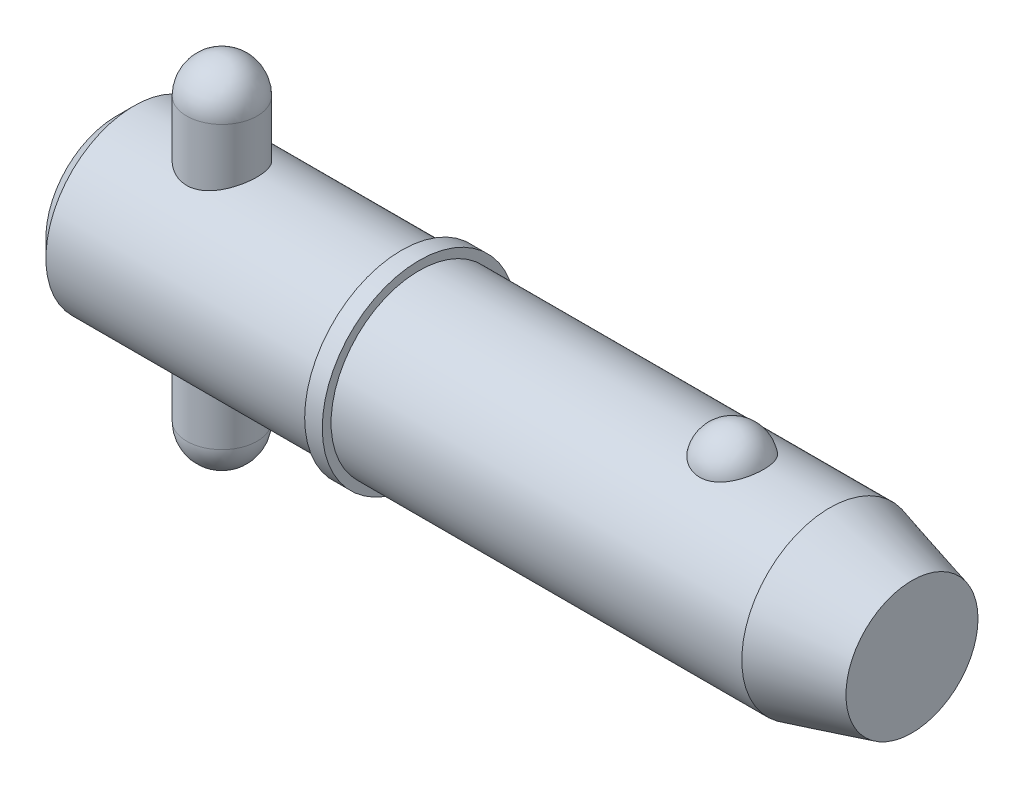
ISO-10303-21;
HEADER;
FILE_DESCRIPTION(('STEP AP214'),'2;1');
FILE_NAME('part.step','',(''),(''),'','','');
FILE_SCHEMA(('AUTOMOTIVE_DESIGN { 1 0 10303 214 1 1 1 1 }'));
ENDSEC;
DATA;
#1=APPLICATION_CONTEXT('core data for automotive mechanical design processes');
#2=APPLICATION_PROTOCOL_DEFINITION('international standard','automotive_design',2000,#1);
#3=PRODUCT_CONTEXT('',#1,'mechanical');
#4=PRODUCT('Part','Part','',(#3));
#5=PRODUCT_RELATED_PRODUCT_CATEGORY('part','',(#4));
#6=PRODUCT_DEFINITION_FORMATION('','',#4);
#7=PRODUCT_DEFINITION_CONTEXT('part definition',#1,'design');
#8=PRODUCT_DEFINITION('design','',#6,#7);
#9=PRODUCT_DEFINITION_SHAPE('','',#8);
#10=(LENGTH_UNIT() NAMED_UNIT(*) SI_UNIT(.MILLI.,.METRE.));
#11=(NAMED_UNIT(*) PLANE_ANGLE_UNIT() SI_UNIT($,.RADIAN.));
#12=(NAMED_UNIT(*) SI_UNIT($,.STERADIAN.) SOLID_ANGLE_UNIT());
#13=UNCERTAINTY_MEASURE_WITH_UNIT(LENGTH_MEASURE(1.E-05),#10,'distance_accuracy_value','');
#14=(GEOMETRIC_REPRESENTATION_CONTEXT(3) GLOBAL_UNCERTAINTY_ASSIGNED_CONTEXT((#13)) GLOBAL_UNIT_ASSIGNED_CONTEXT((#10,
#11,#12)) REPRESENTATION_CONTEXT('',''));
#15=CARTESIAN_POINT('',(0.,0.,0.));
#16=DIRECTION('',(0.,0.,1.));
#17=DIRECTION('',(1.,0.,0.));
#18=AXIS2_PLACEMENT_3D('',#15,#16,#17);
#19=CARTESIAN_POINT('',(9.525,15.875,0.));
#20=DIRECTION('',(0.,-1.,0.));
#21=DIRECTION('',(0.,0.,-1.));
#22=AXIS2_PLACEMENT_3D('',#19,#20,#21);
#23=CYLINDRICAL_SURFACE('',#22,3.175);
#24=CARTESIAN_POINT('',(9.525,-12.7,0.));
#25=DIRECTION('',(0.,-1.,0.));
#26=DIRECTION('',(0.,0.,-1.));
#27=AXIS2_PLACEMENT_3D('',#24,#25,#26);
#28=CIRCLE('',#27,3.175);
#29=CARTESIAN_POINT('',(9.525,-12.7,-3.175));
#30=VERTEX_POINT('',#29);
#31=EDGE_CURVE('P0_E10',#30,#30,#28,.F.);
#32=ORIENTED_EDGE('',*,*,#31,.T.);
#33=EDGE_LOOP('',(#32));
#34=FACE_BOUND('',#33,.T.);
#35=CARTESIAN_POINT('',(9.525,12.7,0.));
#36=DIRECTION('',(0.,-1.,0.));
#37=DIRECTION('',(0.,0.,-1.));
#38=AXIS2_PLACEMENT_3D('',#35,#36,#37);
#39=CIRCLE('',#38,3.175);
#40=CARTESIAN_POINT('',(9.525,12.7,-3.175));
#41=VERTEX_POINT('',#40);
#42=EDGE_CURVE('P0_E21',#41,#41,#39,.T.);
#43=ORIENTED_EDGE('',*,*,#42,.T.);
#44=EDGE_LOOP('',(#43));
#45=FACE_BOUND('',#44,.T.);
#46=ADVANCED_FACE('P0_F14',(#34,#45),#23,.T.);
#47=CARTESIAN_POINT('',(9.525,-12.7,0.));
#48=DIRECTION('',(0.,0.,1.));
#49=DIRECTION('',(1.,0.,0.));
#50=AXIS2_PLACEMENT_3D('',#47,#48,#49);
#51=SPHERICAL_SURFACE('',#50,3.175);
#52=CARTESIAN_POINT('',(9.525,-12.7,0.));
#53=DIRECTION('',(0.,-1.,0.));
#54=DIRECTION('',(0.,0.,-1.));
#55=AXIS2_PLACEMENT_3D('',#52,#53,#54);
#56=SPHERICAL_SURFACE('',#55,3.175);
#57=ORIENTED_EDGE('',*,*,#31,.F.);
#58=EDGE_LOOP('',(#57));
#59=FACE_BOUND('',#58,.T.);
#60=ADVANCED_FACE('P0_F29',(#59),#56,.T.);
#61=CARTESIAN_POINT('',(9.525,12.7,0.));
#62=DIRECTION('',(0.,0.,1.));
#63=DIRECTION('',(1.,0.,0.));
#64=AXIS2_PLACEMENT_3D('',#61,#62,#63);
#65=SPHERICAL_SURFACE('',#64,3.175);
#66=CARTESIAN_POINT('',(9.525,12.7,0.));
#67=DIRECTION('',(0.,-1.,0.));
#68=DIRECTION('',(0.,0.,-1.));
#69=AXIS2_PLACEMENT_3D('',#66,#67,#68);
#70=SPHERICAL_SURFACE('',#69,3.175);
#71=ORIENTED_EDGE('',*,*,#42,.F.);
#72=EDGE_LOOP('',(#71));
#73=FACE_BOUND('',#72,.T.);
#74=ADVANCED_FACE('P0_F16',(#73),#70,.T.);
#75=CLOSED_SHELL('',(#46,#60,#74));
#76=MANIFOLD_SOLID_BREP('P0_B1',#75);
#77=CARTESIAN_POINT('',(0.,0.,0.));
#78=DIRECTION('',(1.,0.,0.));
#79=DIRECTION('',(0.,0.,-1.));
#80=AXIS2_PLACEMENT_3D('',#77,#78,#79);
#81=CYLINDRICAL_SURFACE('',#80,7.94);
#82=CARTESIAN_POINT('',(64.3518791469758,0.,0.));
#83=DIRECTION('',(1.,0.,0.));
#84=DIRECTION('',(0.,0.,-1.));
#85=AXIS2_PLACEMENT_3D('',#82,#83,#84);
#86=CIRCLE('',#85,7.94);
#87=CARTESIAN_POINT('',(64.3518791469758,0.,-7.94));
#88=VERTEX_POINT('',#87);
#89=EDGE_CURVE('P1_E81',#88,#88,#86,.T.);
#90=ORIENTED_EDGE('',*,*,#89,.F.);
#91=EDGE_LOOP('',(#90));
#92=FACE_BOUND('',#91,.T.);
#93=CARTESIAN_POINT('',(27.31,0.,0.));
#94=DIRECTION('',(1.,0.,0.));
#95=DIRECTION('',(0.,0.,-1.));
#96=AXIS2_PLACEMENT_3D('',#93,#94,#95);
#97=CIRCLE('',#96,7.94);
#98=CARTESIAN_POINT('',(27.31,0.,-7.94));
#99=VERTEX_POINT('',#98);
#100=EDGE_CURVE('P1_E85',#99,#99,#97,.T.);
#101=ORIENTED_EDGE('',*,*,#100,.T.);
#102=EDGE_LOOP('',(#101));
#103=FACE_BOUND('',#102,.T.);
#104=CARTESIAN_POINT('',(55.5449074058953,7.37767842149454,2.93486986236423));
#105=CARTESIAN_POINT('',(55.3927496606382,7.3776732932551,2.93487505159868));
#106=CARTESIAN_POINT('',(55.2406329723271,7.38258419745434,2.92262454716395));
#107=CARTESIAN_POINT('',(54.9409284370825,7.40163229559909,2.87404196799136));
#108=CARTESIAN_POINT('',(54.7933394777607,7.41576720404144,2.83771585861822));
#109=CARTESIAN_POINT('',(54.5070187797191,7.4516157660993,2.74218769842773));
#110=CARTESIAN_POINT('',(54.3682745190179,7.47331841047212,2.68301886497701));
#111=CARTESIAN_POINT('',(54.1028822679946,7.52194082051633,2.54350967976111));
#112=CARTESIAN_POINT('',(53.9762366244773,7.5488615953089,2.46316523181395));
#113=CARTESIAN_POINT('',(53.7345349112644,7.60594671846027,2.2809037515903));
#114=CARTESIAN_POINT('',(53.6199065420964,7.63618114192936,2.17844211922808));
#115=CARTESIAN_POINT('',(53.4088787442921,7.69614046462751,1.95608495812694));
#116=CARTESIAN_POINT('',(53.3124826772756,7.72586526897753,1.83618622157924));
#117=CARTESIAN_POINT('',(53.1359381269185,7.78314821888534,1.57628086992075));
#118=CARTESIAN_POINT('',(53.0567072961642,7.81055035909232,1.43561546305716));
#119=CARTESIAN_POINT('',(52.9217979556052,7.85879631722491,1.14236334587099));
#120=CARTESIAN_POINT('',(52.8661216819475,7.87963951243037,0.989775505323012));
#121=CARTESIAN_POINT('',(52.7788121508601,7.91289645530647,0.674619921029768));
#122=CARTESIAN_POINT('',(52.7475309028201,7.925186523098,0.511941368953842));
#123=CARTESIAN_POINT('',(52.710975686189,7.93958930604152,0.183247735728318));
#124=CARTESIAN_POINT('',(52.7057012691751,7.94170219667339,0.0172327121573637));
#125=CARTESIAN_POINT('',(52.7212311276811,7.93554931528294,-0.31267286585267));
#126=CARTESIAN_POINT('',(52.7419253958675,7.92732732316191,-0.4765694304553));
#127=CARTESIAN_POINT('',(52.8087865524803,7.90141534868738,-0.798305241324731));
#128=CARTESIAN_POINT('',(52.8549539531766,7.88372517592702,-0.956144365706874));
#129=CARTESIAN_POINT('',(52.9718986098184,7.84066230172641,-1.26152073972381));
#130=CARTESIAN_POINT('',(53.0427046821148,7.81528060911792,-1.40904568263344));
#131=CARTESIAN_POINT('',(53.2074789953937,7.7594867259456,-1.68950598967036));
#132=CARTESIAN_POINT('',(53.3014488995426,7.72907417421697,-1.82244030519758));
#133=CARTESIAN_POINT('',(53.5108391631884,7.66640424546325,-2.07032792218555));
#134=CARTESIAN_POINT('',(53.6263152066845,7.63414223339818,-2.1852330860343));
#135=CARTESIAN_POINT('',(53.8759006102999,7.57149681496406,-2.39329737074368));
#136=CARTESIAN_POINT('',(54.0100080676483,7.54111321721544,-2.48645870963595));
#137=CARTESIAN_POINT('',(54.2901113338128,7.48650742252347,-2.64628132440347));
#138=CARTESIAN_POINT('',(54.4357605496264,7.46215900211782,-2.71350554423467));
#139=CARTESIAN_POINT('',(54.7374259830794,7.42171253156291,-2.82226614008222));
#140=CARTESIAN_POINT('',(54.8934383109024,7.40561140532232,-2.86381209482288));
#141=CARTESIAN_POINT('',(55.2029708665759,7.3842679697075,-2.9183907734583));
#142=CARTESIAN_POINT('',(55.3562229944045,7.37852109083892,-2.93275024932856));
#143=CARTESIAN_POINT('',(55.6630705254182,7.37700973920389,-2.93655208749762));
#144=CARTESIAN_POINT('',(55.8166658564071,7.38124333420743,-2.92599927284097));
#145=CARTESIAN_POINT('',(56.1149907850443,7.39890635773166,-2.88102897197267));
#146=CARTESIAN_POINT('',(56.2598480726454,7.41205491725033,-2.8473399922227));
#147=CARTESIAN_POINT('',(56.5416432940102,7.445801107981,-2.75788206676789));
#148=CARTESIAN_POINT('',(56.6785805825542,7.46639934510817,-2.70211132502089));
#149=CARTESIAN_POINT('',(56.9440619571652,7.51339098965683,-2.56858908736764));
#150=CARTESIAN_POINT('',(57.0723548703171,7.53990200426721,-2.49038067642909));
#151=CARTESIAN_POINT('',(57.3142440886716,7.59569503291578,-2.31462737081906));
#152=CARTESIAN_POINT('',(57.4278370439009,7.62497767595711,-2.21707808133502));
#153=CARTESIAN_POINT('',(57.64322156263,7.68489473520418,-1.99982049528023));
#154=CARTESIAN_POINT('',(57.7441488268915,7.71552419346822,-1.87925337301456));
#155=CARTESIAN_POINT('',(57.9251866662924,7.77353016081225,-1.62268826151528));
#156=CARTESIAN_POINT('',(58.0052934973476,7.80090608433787,-1.4866875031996));
#157=CARTESIAN_POINT('',(58.1453615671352,7.85047992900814,-1.19818413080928));
#158=CARTESIAN_POINT('',(58.2045877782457,7.8724818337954,-1.04529016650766));
#159=CARTESIAN_POINT('',(58.2979821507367,7.90785114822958,-0.731080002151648));
#160=CARTESIAN_POINT('',(58.3321497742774,7.92121837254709,-0.569763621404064));
#161=CARTESIAN_POINT('',(58.374795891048,7.93797834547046,-0.242812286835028));
#162=CARTESIAN_POINT('',(58.3832047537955,7.94134405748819,-0.0771668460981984));
#163=CARTESIAN_POINT('',(58.3739626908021,7.93767937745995,0.253276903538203));
#164=CARTESIAN_POINT('',(58.3563120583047,7.93064910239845,0.418075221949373));
#165=CARTESIAN_POINT('',(58.2954247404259,7.90695571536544,0.741525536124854));
#166=CARTESIAN_POINT('',(58.2522819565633,7.8903279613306,0.900197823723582));
#167=CARTESIAN_POINT('',(58.1413535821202,7.84916386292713,1.20759654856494));
#168=CARTESIAN_POINT('',(58.07356656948,7.82462706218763,1.35632241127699));
#169=CARTESIAN_POINT('',(57.9143718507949,7.7700669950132,1.64032869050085));
#170=CARTESIAN_POINT('',(57.8228616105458,7.7400200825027,1.77554712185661));
#171=CARTESIAN_POINT('',(57.6182960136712,7.67774175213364,2.02800648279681));
#172=CARTESIAN_POINT('',(57.5052410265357,7.64551037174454,2.14524772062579));
#173=CARTESIAN_POINT('',(57.2608318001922,7.58265895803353,2.35778002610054));
#174=CARTESIAN_POINT('',(57.1295833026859,7.5520309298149,2.45319004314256));
#175=CARTESIAN_POINT('',(56.851601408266,7.49579792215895,2.61999897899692));
#176=CARTESIAN_POINT('',(56.7048670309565,7.47019326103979,2.69139637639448));
#177=CARTESIAN_POINT('',(56.3929477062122,7.42622216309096,2.8105324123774));
#178=CARTESIAN_POINT('',(56.2272209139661,7.40825002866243,2.85700910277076));
#179=CARTESIAN_POINT('',(55.8892792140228,7.38398348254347,2.9191685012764));
#180=CARTESIAN_POINT('',(55.7170670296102,7.3776842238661,2.93486399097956));
#181=CARTESIAN_POINT('',(55.5449074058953,7.37767842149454,2.93486986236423));
#182=B_SPLINE_CURVE_WITH_KNOTS('',3,(#104,#105,#106,#107,#108,#109,#110,#111,#112,#113,#114,
#115,#116,#117,#118,#119,#120,#121,#122,#123,#124,#125,#126,#127,#128,#129,#130,#131,#132,#133,
#134,#135,#136,#137,#138,#139,#140,#141,#142,#143,#144,#145,#146,#147,#148,#149,#150,#151,#152,
#153,#154,#155,#156,#157,#158,#159,#160,#161,#162,#163,#164,#165,#166,#167,#168,#169,#170,#171,
#172,#173,#174,#175,#176,#177,#178,#179,#180,#181),.UNSPECIFIED.,.T.,.F.,(4,2,2,2,2,2,2,2,2,2,2,
2,2,2,2,2,2,2,2,2,2,2,2,2,2,2,2,2,2,2,2,2,2,2,2,2,2,2,4),(0.,0.45584132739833,0.911569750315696,
1.36663794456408,1.82179423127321,2.28978983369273,2.7578716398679,3.246853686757,
3.73588214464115,4.23184282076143,4.72779494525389,5.22165321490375,5.71552141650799,
6.20996917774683,6.70445245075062,7.20023431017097,7.69596557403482,8.18023418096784,
8.66432203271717,9.12410697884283,9.58380291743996,10.0296503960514,10.4755341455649,
10.9312349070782,11.3870393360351,11.8654416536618,12.3439299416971,12.8378875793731,
13.3318558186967,13.8271581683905,14.3224549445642,14.8159385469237,15.3094506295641,
15.8051323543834,16.3008055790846,16.7937101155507,17.2866458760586,17.8026240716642,
18.3183879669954),.UNSPECIFIED.);
#183=CARTESIAN_POINT('',(55.5449074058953,7.37767842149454,2.93486986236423));
#184=VERTEX_POINT('',#183);
#185=EDGE_CURVE('P1_E35',#184,#184,#182,.T.);
#186=ORIENTED_EDGE('',*,*,#185,.T.);
#187=EDGE_LOOP('',(#186));
#188=FACE_BOUND('',#187,.T.);
#189=ADVANCED_FACE('P1_F13',(#92,#103,#188),#81,.T.);
#190=CARTESIAN_POINT('',(0.,0.,0.));
#191=DIRECTION('',(-1.,0.,0.));
#192=DIRECTION('',(0.,0.,1.));
#193=AXIS2_PLACEMENT_3D('',#190,#191,#192);
#194=PLANE('',#193);
#195=CARTESIAN_POINT('',(0.,0.,0.));
#196=DIRECTION('',(1.,0.,0.));
#197=DIRECTION('',(0.,0.,-1.));
#198=AXIS2_PLACEMENT_3D('',#195,#196,#197);
#199=CIRCLE('',#198,6.352);
#200=CARTESIAN_POINT('',(0.,0.,-6.352));
#201=VERTEX_POINT('',#200);
#202=EDGE_CURVE('P1_E9',#201,#201,#199,.T.);
#203=ORIENTED_EDGE('',*,*,#202,.F.);
#204=EDGE_LOOP('',(#203));
#205=FACE_BOUND('',#204,.T.);
#206=ADVANCED_FACE('P1_F15',(#205),#194,.T.);
#207=CARTESIAN_POINT('',(1.58799999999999,0.,0.));
#208=DIRECTION('',(1.,0.,0.));
#209=DIRECTION('',(0.,0.,-1.));
#210=AXIS2_PLACEMENT_3D('',#207,#208,#209);
#211=CONICAL_SURFACE('',#210,7.94,0.78539816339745);
#212=ORIENTED_EDGE('',*,*,#202,.T.);
#213=EDGE_LOOP('',(#212));
#214=FACE_BOUND('',#213,.T.);
#215=CARTESIAN_POINT('',(1.58799999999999,0.,0.));
#216=DIRECTION('',(1.,0.,0.));
#217=DIRECTION('',(0.,0.,-1.));
#218=AXIS2_PLACEMENT_3D('',#215,#216,#217);
#219=CIRCLE('',#218,7.94);
#220=CARTESIAN_POINT('',(1.58799999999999,0.,-7.94));
#221=VERTEX_POINT('',#220);
#222=EDGE_CURVE('P1_E26',#221,#221,#219,.T.);
#223=ORIENTED_EDGE('',*,*,#222,.F.);
#224=EDGE_LOOP('',(#223));
#225=FACE_BOUND('',#224,.T.);
#226=ADVANCED_FACE('P1_F77',(#214,#225),#211,.T.);
#227=CARTESIAN_POINT('',(0.,0.,0.));
#228=DIRECTION('',(1.,0.,0.));
#229=DIRECTION('',(0.,0.,-1.));
#230=AXIS2_PLACEMENT_3D('',#227,#228,#229);
#231=CYLINDRICAL_SURFACE('',#230,7.94);
#232=CARTESIAN_POINT('',(9.525,-7.27756655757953,3.175));
#233=CARTESIAN_POINT('',(9.43992346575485,-7.27756715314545,3.17499935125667));
#234=CARTESIAN_POINT('',(9.35481882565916,-7.27906496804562,3.1715736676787));
#235=CARTESIAN_POINT('',(9.18524505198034,-7.28499816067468,3.15791803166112));
#236=CARTESIAN_POINT('',(9.100776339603,-7.28943533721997,3.14768391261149));
#237=CARTESIAN_POINT('',(8.84895715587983,-7.30698881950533,3.10684226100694));
#238=CARTESIAN_POINT('',(8.6834173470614,-7.32434654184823,3.06609574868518));
#239=CARTESIAN_POINT('',(8.36278910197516,-7.36806950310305,2.95945910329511));
#240=CARTESIAN_POINT('',(8.20766386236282,-7.39440078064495,2.89366366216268));
#241=CARTESIAN_POINT('',(7.91065319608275,-7.45304562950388,2.73907413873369));
#242=CARTESIAN_POINT('',(7.76876488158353,-7.48535789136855,2.65028508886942));
#243=CARTESIAN_POINT('',(7.49411086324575,-7.55439482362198,2.44679888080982));
#244=CARTESIAN_POINT('',(7.36219910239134,-7.59126138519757,2.33099745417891));
#245=CARTESIAN_POINT('',(7.11904234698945,-7.66408045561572,2.07909838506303));
#246=CARTESIAN_POINT('',(7.00780457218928,-7.70003264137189,1.94299368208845));
#247=CARTESIAN_POINT('',(6.80492173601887,-7.76867514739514,1.64775981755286));
#248=CARTESIAN_POINT('',(6.71422139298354,-7.80118112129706,1.48793473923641));
#249=CARTESIAN_POINT('',(6.56135788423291,-7.85754918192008,1.15376269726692));
#250=CARTESIAN_POINT('',(6.49918311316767,-7.88141478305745,0.979421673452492));
#251=CARTESIAN_POINT('',(6.40818142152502,-7.91680873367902,0.630115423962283));
#252=CARTESIAN_POINT('',(6.3778864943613,-7.9288781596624,0.455588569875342));
#253=CARTESIAN_POINT('',(6.34677743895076,-7.94127547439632,0.103539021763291));
#254=CARTESIAN_POINT('',(6.34595232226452,-7.94160773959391,-0.0739825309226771));
#255=CARTESIAN_POINT('',(6.37300128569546,-7.93082261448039,-0.416371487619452));
#256=CARTESIAN_POINT('',(6.39926693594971,-7.92034690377,-0.581389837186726));
#257=CARTESIAN_POINT('',(6.47701615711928,-7.88998770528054,-0.904449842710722));
#258=CARTESIAN_POINT('',(6.52850157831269,-7.87010352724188,-1.06249098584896));
#259=CARTESIAN_POINT('',(6.65586120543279,-7.82249343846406,-1.36995769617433));
#260=CARTESIAN_POINT('',(6.73209124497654,-7.79465387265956,-1.51921754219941));
#261=CARTESIAN_POINT('',(6.90644286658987,-7.73389606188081,-1.80321183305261));
#262=CARTESIAN_POINT('',(7.00457194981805,-7.70097607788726,-1.93794127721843));
#263=CARTESIAN_POINT('',(7.22744086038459,-7.63084889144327,-2.19843606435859));
#264=CARTESIAN_POINT('',(7.35350432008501,-7.59350211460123,-2.3230330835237));
#265=CARTESIAN_POINT('',(7.62488266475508,-7.52039654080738,-2.54979642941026));
#266=CARTESIAN_POINT('',(7.77020381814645,-7.48463826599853,-2.65195542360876));
#267=CARTESIAN_POINT('',(8.08119298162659,-7.41780943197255,-2.83361305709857));
#268=CARTESIAN_POINT('',(8.24731937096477,-7.38689959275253,-2.91239105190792));
#269=CARTESIAN_POINT('',(8.59204539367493,-7.33515216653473,-3.04038913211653));
#270=CARTESIAN_POINT('',(8.77063684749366,-7.31430804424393,-3.08962840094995));
#271=CARTESIAN_POINT('',(9.12356982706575,-7.28663831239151,-3.15431018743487));
#272=CARTESIAN_POINT('',(9.29750494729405,-7.2790344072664,-3.17163284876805));
#273=CARTESIAN_POINT('',(9.64592502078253,-7.27648884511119,-3.17747282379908));
#274=CARTESIAN_POINT('',(9.82040979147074,-7.28154335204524,-3.16599886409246));
#275=CARTESIAN_POINT('',(10.1545374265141,-7.30294638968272,-3.11628310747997));
#276=CARTESIAN_POINT('',(10.3144598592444,-7.31863587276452,-3.0796016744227));
#277=CARTESIAN_POINT('',(10.625774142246,-7.35872371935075,-2.98253618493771));
#278=CARTESIAN_POINT('',(10.7771640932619,-7.38312401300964,-2.92214687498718));
#279=CARTESIAN_POINT('',(11.0739599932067,-7.4390944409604,-2.77664664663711));
#280=CARTESIAN_POINT('',(11.2188745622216,-7.47091513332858,-2.69063278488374));
#281=CARTESIAN_POINT('',(11.4928722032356,-7.53775867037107,-2.49724834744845));
#282=CARTESIAN_POINT('',(11.6219487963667,-7.57278281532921,-2.38986907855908));
#283=CARTESIAN_POINT('',(11.8705091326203,-7.64520845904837,-2.1474449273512));
#284=CARTESIAN_POINT('',(11.9885816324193,-7.68259462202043,-2.01094304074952));
#285=CARTESIAN_POINT('',(12.2003631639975,-7.75309951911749,-1.71917041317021));
#286=CARTESIAN_POINT('',(12.2940712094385,-7.78621808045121,-1.56389891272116));
#287=CARTESIAN_POINT('',(12.4541161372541,-7.84456050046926,-1.23845027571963));
#288=CARTESIAN_POINT('',(12.5204600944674,-7.86978639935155,-1.06827700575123));
#289=CARTESIAN_POINT('',(12.6231407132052,-7.90943635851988,-0.717928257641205));
#290=CARTESIAN_POINT('',(12.6594936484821,-7.92386627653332,-0.537758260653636));
#291=CARTESIAN_POINT('',(12.6992281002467,-7.93967263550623,-0.185201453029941));
#292=CARTESIAN_POINT('',(12.7046050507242,-7.94183891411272,-0.0130732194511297));
#293=CARTESIAN_POINT('',(12.6875036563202,-7.9350072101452,0.329549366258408));
#294=CARTESIAN_POINT('',(12.6650295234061,-7.92601091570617,0.500043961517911));
#295=CARTESIAN_POINT('',(12.5942896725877,-7.89825976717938,0.829196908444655));
#296=CARTESIAN_POINT('',(12.5468364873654,-7.87981280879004,0.988057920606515));
#297=CARTESIAN_POINT('',(12.4283390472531,-7.83513565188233,1.29553461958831));
#298=CARTESIAN_POINT('',(12.3572904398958,-7.8089040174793,1.44414841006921));
#299=CARTESIAN_POINT('',(12.1900822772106,-7.7497911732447,1.73412879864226));
#300=CARTESIAN_POINT('',(12.0929519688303,-7.71666737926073,1.87488510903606));
#301=CARTESIAN_POINT('',(11.8777894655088,-7.64775894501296,2.13869231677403));
#302=CARTESIAN_POINT('',(11.7597486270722,-7.61197320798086,2.26173585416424));
#303=CARTESIAN_POINT('',(11.4974896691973,-7.53902341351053,2.49449755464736));
#304=CARTESIAN_POINT('',(11.3521039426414,-7.50191102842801,2.60292060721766));
#305=CARTESIAN_POINT('',(11.0440201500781,-7.43289551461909,2.79392602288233));
#306=CARTESIAN_POINT('',(10.8813200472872,-7.40099299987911,2.87650534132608));
#307=CARTESIAN_POINT('',(10.558064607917,-7.3489506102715,3.00682739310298));
#308=CARTESIAN_POINT('',(10.398627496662,-7.32801197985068,3.05703164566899));
#309=CARTESIAN_POINT('',(10.0731242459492,-7.29639491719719,3.13175843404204));
#310=CARTESIAN_POINT('',(9.90707793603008,-7.28568789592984,3.15635254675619));
#311=CARTESIAN_POINT('',(9.70441566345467,-7.27968826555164,3.17013149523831));
#312=CARTESIAN_POINT('',(9.66856669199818,-7.27889378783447,3.17195593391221));
#313=CARTESIAN_POINT('',(9.59681348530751,-7.27783278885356,3.17439036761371));
#314=CARTESIAN_POINT('',(9.56090924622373,-7.27756630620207,3.17500027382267));
#315=CARTESIAN_POINT('',(9.525,-7.27756655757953,3.175));
#316=B_SPLINE_CURVE_WITH_KNOTS('',3,(#232,#233,#234,#235,#236,#237,#238,#239,#240,#241,#242,
#243,#244,#245,#246,#247,#248,#249,#250,#251,#252,#253,#254,#255,#256,#257,#258,#259,#260,#261,
#262,#263,#264,#265,#266,#267,#268,#269,#270,#271,#272,#273,#274,#275,#276,#277,#278,#279,#280,
#281,#282,#283,#284,#285,#286,#287,#288,#289,#290,#291,#292,#293,#294,#295,#296,#297,#298,#299,
#300,#301,#302,#303,#304,#305,#306,#307,#308,#309,#310,#311,#312,#313,#314,#315),.UNSPECIFIED.,
.T.,.F.,(4,2,2,2,2,2,2,2,2,2,2,2,2,2,2,2,2,2,2,2,2,2,2,2,2,2,2,2,2,2,2,2,2,2,2,2,2,2,2,2,2,4),
(0.,0.255187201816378,0.510530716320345,1.0218798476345,1.53131482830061,2.04063840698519,
2.57635929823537,3.11226692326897,3.66929090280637,4.22608806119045,4.75594400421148,
5.28560237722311,5.78552836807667,6.28549104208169,6.79298787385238,7.30065880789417,
7.8416422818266,8.38280228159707,8.93923025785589,9.49529647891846,10.0174074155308,
10.5393601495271,11.0316114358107,11.5239718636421,12.0362920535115,12.5488211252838,
13.0991799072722,13.6495609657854,14.1997996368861,14.7497395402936,15.2638187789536,
15.7778202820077,16.2760504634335,16.7743726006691,17.294711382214,17.8152657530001,
18.3680208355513,18.9208410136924,19.4240423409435,19.9258334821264,20.0335354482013,
20.1412452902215),.UNSPECIFIED.);
#317=CARTESIAN_POINT('',(9.525,-7.27756655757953,3.175));
#318=VERTEX_POINT('',#317);
#319=EDGE_CURVE('P1_E17',#318,#318,#316,.T.);
#320=ORIENTED_EDGE('',*,*,#319,.F.);
#321=EDGE_LOOP('',(#320));
#322=FACE_BOUND('',#321,.T.);
#323=CARTESIAN_POINT('',(9.525,7.27756655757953,3.175));
#324=CARTESIAN_POINT('',(9.61007653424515,7.27756715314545,3.17499935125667));
#325=CARTESIAN_POINT('',(9.69518117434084,7.27906496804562,3.1715736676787));
#326=CARTESIAN_POINT('',(9.86475494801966,7.28499816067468,3.15791803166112));
#327=CARTESIAN_POINT('',(9.949223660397,7.28943533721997,3.14768391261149));
#328=CARTESIAN_POINT('',(10.2010428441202,7.30698881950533,3.10684226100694));
#329=CARTESIAN_POINT('',(10.3665826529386,7.32434654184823,3.06609574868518));
#330=CARTESIAN_POINT('',(10.6872108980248,7.36806950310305,2.95945910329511));
#331=CARTESIAN_POINT('',(10.8423361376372,7.39440078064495,2.89366366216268));
#332=CARTESIAN_POINT('',(11.1393468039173,7.45304562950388,2.73907413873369));
#333=CARTESIAN_POINT('',(11.2812351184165,7.48535789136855,2.65028508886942));
#334=CARTESIAN_POINT('',(11.5558891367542,7.55439482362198,2.44679888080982));
#335=CARTESIAN_POINT('',(11.6878008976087,7.59126138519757,2.33099745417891));
#336=CARTESIAN_POINT('',(11.9309576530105,7.66408045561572,2.07909838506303));
#337=CARTESIAN_POINT('',(12.0421954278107,7.70003264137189,1.94299368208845));
#338=CARTESIAN_POINT('',(12.2450782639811,7.76867514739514,1.64775981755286));
#339=CARTESIAN_POINT('',(12.3357786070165,7.80118112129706,1.48793473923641));
#340=CARTESIAN_POINT('',(12.4886421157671,7.85754918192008,1.15376269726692));
#341=CARTESIAN_POINT('',(12.5508168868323,7.88141478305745,0.979421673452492));
#342=CARTESIAN_POINT('',(12.641818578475,7.91680873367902,0.630115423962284));
#343=CARTESIAN_POINT('',(12.6721135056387,7.9288781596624,0.455588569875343));
#344=CARTESIAN_POINT('',(12.7032225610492,7.94127547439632,0.103539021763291));
#345=CARTESIAN_POINT('',(12.7040476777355,7.94160773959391,-0.0739825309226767));
#346=CARTESIAN_POINT('',(12.6769987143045,7.93082261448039,-0.416371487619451));
#347=CARTESIAN_POINT('',(12.6507330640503,7.92034690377,-0.581389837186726));
#348=CARTESIAN_POINT('',(12.5729838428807,7.88998770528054,-0.904449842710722));
#349=CARTESIAN_POINT('',(12.5214984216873,7.87010352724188,-1.06249098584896));
#350=CARTESIAN_POINT('',(12.3941387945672,7.82249343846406,-1.36995769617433));
#351=CARTESIAN_POINT('',(12.3179087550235,7.79465387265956,-1.51921754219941));
#352=CARTESIAN_POINT('',(12.1435571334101,7.73389606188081,-1.80321183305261));
#353=CARTESIAN_POINT('',(12.0454280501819,7.70097607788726,-1.93794127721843));
#354=CARTESIAN_POINT('',(11.8225591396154,7.63084889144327,-2.19843606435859));
#355=CARTESIAN_POINT('',(11.696495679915,7.59350211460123,-2.3230330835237));
#356=CARTESIAN_POINT('',(11.4251173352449,7.52039654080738,-2.54979642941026));
#357=CARTESIAN_POINT('',(11.2797961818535,7.48463826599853,-2.65195542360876));
#358=CARTESIAN_POINT('',(10.9688070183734,7.41780943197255,-2.83361305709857));
#359=CARTESIAN_POINT('',(10.8026806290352,7.38689959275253,-2.91239105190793));
#360=CARTESIAN_POINT('',(10.4579546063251,7.33515216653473,-3.04038913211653));
#361=CARTESIAN_POINT('',(10.2793631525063,7.31430804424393,-3.08962840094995));
#362=CARTESIAN_POINT('',(9.92643017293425,7.28663831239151,-3.15431018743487));
#363=CARTESIAN_POINT('',(9.75249505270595,7.2790344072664,-3.17163284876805));
#364=CARTESIAN_POINT('',(9.40407497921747,7.2764888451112,-3.17747282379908));
#365=CARTESIAN_POINT('',(9.22959020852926,7.28154335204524,-3.16599886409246));
#366=CARTESIAN_POINT('',(8.89546257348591,7.30294638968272,-3.11628310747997));
#367=CARTESIAN_POINT('',(8.73554014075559,7.31863587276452,-3.0796016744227));
#368=CARTESIAN_POINT('',(8.42422585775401,7.35872371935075,-2.98253618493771));
#369=CARTESIAN_POINT('',(8.27283590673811,7.38312401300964,-2.92214687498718));
#370=CARTESIAN_POINT('',(7.97604000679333,7.4390944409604,-2.77664664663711));
#371=CARTESIAN_POINT('',(7.83112543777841,7.47091513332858,-2.69063278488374));
#372=CARTESIAN_POINT('',(7.55712779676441,7.53775867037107,-2.49724834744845));
#373=CARTESIAN_POINT('',(7.42805120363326,7.57278281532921,-2.38986907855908));
#374=CARTESIAN_POINT('',(7.17949086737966,7.64520845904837,-2.1474449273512));
#375=CARTESIAN_POINT('',(7.06141836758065,7.68259462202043,-2.01094304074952));
#376=CARTESIAN_POINT('',(6.8496368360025,7.75309951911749,-1.71917041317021));
#377=CARTESIAN_POINT('',(6.75592879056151,7.78621808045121,-1.56389891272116));
#378=CARTESIAN_POINT('',(6.59588386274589,7.84456050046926,-1.23845027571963));
#379=CARTESIAN_POINT('',(6.52953990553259,7.86978639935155,-1.06827700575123));
#380=CARTESIAN_POINT('',(6.42685928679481,7.90943635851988,-0.717928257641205));
#381=CARTESIAN_POINT('',(6.39050635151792,7.92386627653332,-0.537758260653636));
#382=CARTESIAN_POINT('',(6.35077189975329,7.93967263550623,-0.18520145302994));
#383=CARTESIAN_POINT('',(6.34539494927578,7.94183891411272,-0.0130732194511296));
#384=CARTESIAN_POINT('',(6.36249634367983,7.9350072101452,0.329549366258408));
#385=CARTESIAN_POINT('',(6.38497047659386,7.92601091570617,0.500043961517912));
#386=CARTESIAN_POINT('',(6.45571032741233,7.89825976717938,0.829196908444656));
#387=CARTESIAN_POINT('',(6.50316351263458,7.87981280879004,0.988057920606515));
#388=CARTESIAN_POINT('',(6.62166095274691,7.83513565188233,1.29553461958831));
#389=CARTESIAN_POINT('',(6.69270956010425,7.8089040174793,1.44414841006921));
#390=CARTESIAN_POINT('',(6.85991772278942,7.7497911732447,1.73412879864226));
#391=CARTESIAN_POINT('',(6.95704803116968,7.71666737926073,1.87488510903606));
#392=CARTESIAN_POINT('',(7.17221053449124,7.64775894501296,2.13869231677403));
#393=CARTESIAN_POINT('',(7.29025137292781,7.61197320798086,2.26173585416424));
#394=CARTESIAN_POINT('',(7.55251033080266,7.53902341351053,2.49449755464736));
#395=CARTESIAN_POINT('',(7.69789605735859,7.50191102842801,2.60292060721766));
#396=CARTESIAN_POINT('',(8.00597984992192,7.43289551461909,2.79392602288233));
#397=CARTESIAN_POINT('',(8.16867995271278,7.40099299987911,2.87650534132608));
#398=CARTESIAN_POINT('',(8.49193539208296,7.3489506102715,3.00682739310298));
#399=CARTESIAN_POINT('',(8.65137250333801,7.32801197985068,3.05703164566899));
#400=CARTESIAN_POINT('',(8.97687575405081,7.29639491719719,3.13175843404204));
#401=CARTESIAN_POINT('',(9.14292206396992,7.28568789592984,3.15635254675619));
#402=CARTESIAN_POINT('',(9.34558433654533,7.27968826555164,3.17013149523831));
#403=CARTESIAN_POINT('',(9.38143330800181,7.27889378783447,3.17195593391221));
#404=CARTESIAN_POINT('',(9.45318651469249,7.27783278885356,3.17439036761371));
#405=CARTESIAN_POINT('',(9.48909075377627,7.27756630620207,3.17500027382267));
#406=CARTESIAN_POINT('',(9.525,7.27756655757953,3.175));
#407=B_SPLINE_CURVE_WITH_KNOTS('',3,(#323,#324,#325,#326,#327,#328,#329,#330,#331,#332,#333,
#334,#335,#336,#337,#338,#339,#340,#341,#342,#343,#344,#345,#346,#347,#348,#349,#350,#351,#352,
#353,#354,#355,#356,#357,#358,#359,#360,#361,#362,#363,#364,#365,#366,#367,#368,#369,#370,#371,
#372,#373,#374,#375,#376,#377,#378,#379,#380,#381,#382,#383,#384,#385,#386,#387,#388,#389,#390,
#391,#392,#393,#394,#395,#396,#397,#398,#399,#400,#401,#402,#403,#404,#405,#406),.UNSPECIFIED.,
.T.,.F.,(4,2,2,2,2,2,2,2,2,2,2,2,2,2,2,2,2,2,2,2,2,2,2,2,2,2,2,2,2,2,2,2,2,2,2,2,2,2,2,2,2,4),
(0.,0.255187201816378,0.510530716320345,1.0218798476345,1.53131482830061,2.04063840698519,
2.57635929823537,3.11226692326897,3.66929090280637,4.22608806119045,4.75594400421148,
5.2856023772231,5.78552836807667,6.28549104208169,6.79298787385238,7.30065880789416,
7.8416422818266,8.38280228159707,8.9392302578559,9.49529647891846,10.0174074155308,
10.5393601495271,11.0316114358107,11.5239718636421,12.0362920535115,12.5488211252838,
13.0991799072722,13.6495609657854,14.1997996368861,14.7497395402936,15.2638187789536,
15.7778202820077,16.2760504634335,16.7743726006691,17.294711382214,17.8152657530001,
18.3680208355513,18.9208410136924,19.4240423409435,19.9258334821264,20.0335354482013,
20.1412452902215),.UNSPECIFIED.);
#408=CARTESIAN_POINT('',(9.525,7.27756655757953,3.175));
#409=VERTEX_POINT('',#408);
#410=EDGE_CURVE('P1_E43',#409,#409,#407,.T.);
#411=ORIENTED_EDGE('',*,*,#410,.F.);
#412=EDGE_LOOP('',(#411));
#413=FACE_BOUND('',#412,.T.);
#414=ORIENTED_EDGE('',*,*,#222,.T.);
#415=EDGE_LOOP('',(#414));
#416=FACE_BOUND('',#415,.T.);
#417=CARTESIAN_POINT('',(25.722,0.,0.));
#418=DIRECTION('',(1.,0.,0.));
#419=DIRECTION('',(0.,0.,-1.));
#420=AXIS2_PLACEMENT_3D('',#417,#418,#419);
#421=CIRCLE('',#420,7.94);
#422=CARTESIAN_POINT('',(25.722,0.,-7.94));
#423=VERTEX_POINT('',#422);
#424=EDGE_CURVE('P1_E31',#423,#423,#421,.T.);
#425=ORIENTED_EDGE('',*,*,#424,.F.);
#426=EDGE_LOOP('',(#425));
#427=FACE_BOUND('',#426,.T.);
#428=ADVANCED_FACE('P1_F103',(#322,#413,#416,#427),#231,.T.);
#429=CARTESIAN_POINT('',(25.722,7.94,0.));
#430=DIRECTION('',(-1.,0.,0.));
#431=DIRECTION('',(0.,0.,1.));
#432=AXIS2_PLACEMENT_3D('',#429,#430,#431);
#433=PLANE('',#432);
#434=ORIENTED_EDGE('',*,*,#424,.T.);
#435=EDGE_LOOP('',(#434));
#436=FACE_BOUND('',#435,.T.);
#437=CARTESIAN_POINT('',(25.722,0.,0.));
#438=DIRECTION('',(1.,0.,0.));
#439=DIRECTION('',(0.,0.,-1.));
#440=AXIS2_PLACEMENT_3D('',#437,#438,#439);
#441=CIRCLE('',#440,8.734);
#442=CARTESIAN_POINT('',(25.722,0.,-8.734));
#443=VERTEX_POINT('',#442);
#444=EDGE_CURVE('P1_E91',#443,#443,#441,.T.);
#445=ORIENTED_EDGE('',*,*,#444,.F.);
#446=EDGE_LOOP('',(#445));
#447=FACE_BOUND('',#446,.T.);
#448=ADVANCED_FACE('P1_F100',(#436,#447),#433,.T.);
#449=CARTESIAN_POINT('',(0.,0.,0.));
#450=DIRECTION('',(1.,0.,0.));
#451=DIRECTION('',(0.,0.,-1.));
#452=AXIS2_PLACEMENT_3D('',#449,#450,#451);
#453=CYLINDRICAL_SURFACE('',#452,8.734);
#454=ORIENTED_EDGE('',*,*,#444,.T.);
#455=EDGE_LOOP('',(#454));
#456=FACE_BOUND('',#455,.T.);
#457=CARTESIAN_POINT('',(27.31,0.,0.));
#458=DIRECTION('',(1.,0.,0.));
#459=DIRECTION('',(0.,0.,-1.));
#460=AXIS2_PLACEMENT_3D('',#457,#458,#459);
#461=CIRCLE('',#460,8.734);
#462=CARTESIAN_POINT('',(27.31,0.,-8.734));
#463=VERTEX_POINT('',#462);
#464=EDGE_CURVE('P1_E88',#463,#463,#461,.T.);
#465=ORIENTED_EDGE('',*,*,#464,.F.);
#466=EDGE_LOOP('',(#465));
#467=FACE_BOUND('',#466,.T.);
#468=ADVANCED_FACE('P1_F68',(#456,#467),#453,.T.);
#469=CARTESIAN_POINT('',(27.31,8.734,0.));
#470=DIRECTION('',(1.,0.,0.));
#471=DIRECTION('',(0.,0.,-1.));
#472=AXIS2_PLACEMENT_3D('',#469,#470,#471);
#473=PLANE('',#472);
#474=ORIENTED_EDGE('',*,*,#464,.T.);
#475=EDGE_LOOP('',(#474));
#476=FACE_BOUND('',#475,.T.);
#477=ORIENTED_EDGE('',*,*,#100,.F.);
#478=EDGE_LOOP('',(#477));
#479=FACE_BOUND('',#478,.T.);
#480=ADVANCED_FACE('P1_F62',(#476,#479),#473,.T.);
#481=CARTESIAN_POINT('',(71.76,0.,0.));
#482=DIRECTION('',(-1.,0.,0.));
#483=DIRECTION('',(0.,0.,1.));
#484=AXIS2_PLACEMENT_3D('',#481,#482,#483);
#485=CONICAL_SURFACE('',#484,5.95500000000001,0.26179938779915);
#486=ORIENTED_EDGE('',*,*,#89,.T.);
#487=EDGE_LOOP('',(#486));
#488=FACE_BOUND('',#487,.T.);
#489=CARTESIAN_POINT('',(71.76,0.,0.));
#490=DIRECTION('',(1.,0.,0.));
#491=DIRECTION('',(0.,0.,-1.));
#492=AXIS2_PLACEMENT_3D('',#489,#490,#491);
#493=CIRCLE('',#492,5.95500000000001);
#494=CARTESIAN_POINT('',(71.76,0.,-5.95500000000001));
#495=VERTEX_POINT('',#494);
#496=EDGE_CURVE('P1_E42',#495,#495,#493,.T.);
#497=ORIENTED_EDGE('',*,*,#496,.F.);
#498=EDGE_LOOP('',(#497));
#499=FACE_BOUND('',#498,.T.);
#500=ADVANCED_FACE('P1_F59',(#488,#499),#485,.T.);
#501=CARTESIAN_POINT('',(71.76,5.95500000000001,0.));
#502=DIRECTION('',(1.,0.,0.));
#503=DIRECTION('',(0.,0.,-1.));
#504=AXIS2_PLACEMENT_3D('',#501,#502,#503);
#505=PLANE('',#504);
#506=ORIENTED_EDGE('',*,*,#496,.T.);
#507=EDGE_LOOP('',(#506));
#508=FACE_BOUND('',#507,.T.);
#509=ADVANCED_FACE('P1_F55',(#508),#505,.T.);
#510=CARTESIAN_POINT('',(55.5449074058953,7.146,0.));
#511=DIRECTION('',(-1.,0.,0.));
#512=DIRECTION('',(0.,1.,0.));
#513=AXIS2_PLACEMENT_3D('',#510,#511,#512);
#514=SPHERICAL_SURFACE('',#513,2.944);
#515=ORIENTED_EDGE('',*,*,#185,.F.);
#516=EDGE_LOOP('',(#515));
#517=FACE_BOUND('',#516,.T.);
#518=ADVANCED_FACE('P1_F50',(#517),#514,.T.);
#519=CARTESIAN_POINT('',(9.525,-8.734,0.));
#520=DIRECTION('',(0.,1.,0.));
#521=DIRECTION('',(0.,0.,1.));
#522=AXIS2_PLACEMENT_3D('',#519,#520,#521);
#523=CYLINDRICAL_SURFACE('',#522,3.175);
#524=ORIENTED_EDGE('',*,*,#319,.T.);
#525=EDGE_LOOP('',(#524));
#526=FACE_BOUND('',#525,.T.);
#527=ORIENTED_EDGE('',*,*,#410,.T.);
#528=EDGE_LOOP('',(#527));
#529=FACE_BOUND('',#528,.T.);
#530=ADVANCED_FACE('P1_F54',(#526,#529),#523,.F.);
#531=CLOSED_SHELL('',(#189,#206,#226,#428,#448,#468,#480,#500,#509,#518,#530));
#532=MANIFOLD_SOLID_BREP('P1_B1',#531);
#533=ADVANCED_BREP_SHAPE_REPRESENTATION('',(#18,#76,#532),#14);
#534=SHAPE_DEFINITION_REPRESENTATION(#9,#533);
ENDSEC;
END-ISO-10303-21;
